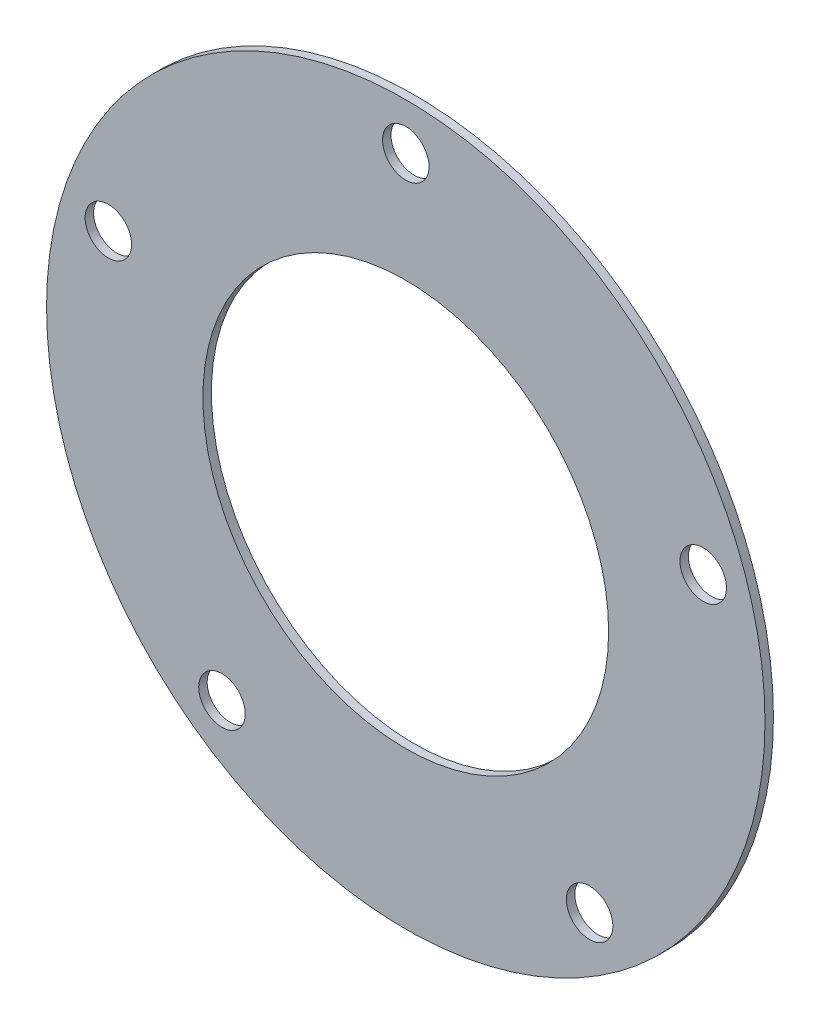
ISO-10303-21;
HEADER;
FILE_DESCRIPTION(('STEP AP214'),'2;1');
FILE_NAME('part.step','',(''),(''),'','','');
FILE_SCHEMA(('AUTOMOTIVE_DESIGN { 1 0 10303 214 1 1 1 1 }'));
ENDSEC;
DATA;
#1=APPLICATION_CONTEXT('core data for automotive mechanical design processes');
#2=APPLICATION_PROTOCOL_DEFINITION('international standard','automotive_design',2000,#1);
#3=PRODUCT_CONTEXT('',#1,'mechanical');
#4=PRODUCT('Part','Part','',(#3));
#5=PRODUCT_RELATED_PRODUCT_CATEGORY('part','',(#4));
#6=PRODUCT_DEFINITION_FORMATION('','',#4);
#7=PRODUCT_DEFINITION_CONTEXT('part definition',#1,'design');
#8=PRODUCT_DEFINITION('design','',#6,#7);
#9=PRODUCT_DEFINITION_SHAPE('','',#8);
#10=(LENGTH_UNIT() NAMED_UNIT(*) SI_UNIT(.MILLI.,.METRE.));
#11=(NAMED_UNIT(*) PLANE_ANGLE_UNIT() SI_UNIT($,.RADIAN.));
#12=(NAMED_UNIT(*) SI_UNIT($,.STERADIAN.) SOLID_ANGLE_UNIT());
#13=UNCERTAINTY_MEASURE_WITH_UNIT(LENGTH_MEASURE(1.E-05),#10,'distance_accuracy_value','');
#14=(GEOMETRIC_REPRESENTATION_CONTEXT(3) GLOBAL_UNCERTAINTY_ASSIGNED_CONTEXT((#13)) GLOBAL_UNIT_ASSIGNED_CONTEXT((#10,
#11,#12)) REPRESENTATION_CONTEXT('',''));
#15=CARTESIAN_POINT('',(0.,0.,0.));
#16=DIRECTION('',(0.,0.,1.));
#17=DIRECTION('',(1.,0.,0.));
#18=AXIS2_PLACEMENT_3D('',#15,#16,#17);
#19=CARTESIAN_POINT('',(0.,0.,1.));
#20=DIRECTION('',(0.,0.,1.));
#21=DIRECTION('',(1.,0.,0.));
#22=AXIS2_PLACEMENT_3D('',#19,#20,#21);
#23=PLANE('',#22);
#24=CARTESIAN_POINT('',(-35.1890911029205,11.4336287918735,1.));
#25=DIRECTION('',(0.,0.,1.));
#26=DIRECTION('',(0.309016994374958,0.95105651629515,0.));
#27=AXIS2_PLACEMENT_3D('',#24,#25,#26);
#28=CIRCLE('',#27,2.75);
#29=CARTESIAN_POINT('',(-34.3392943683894,14.0490342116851,1.));
#30=VERTEX_POINT('',#29);
#31=EDGE_CURVE('E69',#30,#30,#28,.T.);
#32=ORIENTED_EDGE('',*,*,#31,.F.);
#33=EDGE_LOOP('',(#32));
#34=FACE_BOUND('',#33,.T.);
#35=CARTESIAN_POINT('',(-21.7480543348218,-29.9336287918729,1.));
#36=DIRECTION('',(0.,0.,1.));
#37=DIRECTION('',(-0.809016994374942,0.58778525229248,0.));
#38=AXIS2_PLACEMENT_3D('',#35,#36,#37);
#39=CIRCLE('',#38,2.75);
#40=CARTESIAN_POINT('',(-23.9728510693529,-28.3172193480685,1.));
#41=VERTEX_POINT('',#40);
#42=EDGE_CURVE('E63',#41,#41,#39,.T.);
#43=ORIENTED_EDGE('',*,*,#42,.F.);
#44=EDGE_LOOP('',(#43));
#45=FACE_BOUND('',#44,.T.);
#46=CARTESIAN_POINT('',(21.7480543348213,-29.9336287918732,1.));
#47=DIRECTION('',(0.,0.,1.));
#48=DIRECTION('',(-0.809016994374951,-0.587785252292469,0.));
#49=AXIS2_PLACEMENT_3D('',#46,#47,#48);
#50=CIRCLE('',#49,2.75);
#51=CARTESIAN_POINT('',(19.5232576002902,-31.5500382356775,1.));
#52=VERTEX_POINT('',#51);
#53=EDGE_CURVE('E57',#52,#52,#50,.T.);
#54=ORIENTED_EDGE('',*,*,#53,.F.);
#55=EDGE_LOOP('',(#54));
#56=FACE_BOUND('',#55,.T.);
#57=CARTESIAN_POINT('',(35.1890911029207,11.433628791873,1.));
#58=DIRECTION('',(0.,0.,1.));
#59=DIRECTION('',(0.309016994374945,-0.951056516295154,0.));
#60=AXIS2_PLACEMENT_3D('',#57,#58,#59);
#61=CIRCLE('',#60,2.75);
#62=CARTESIAN_POINT('',(36.0388878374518,8.81822337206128,1.));
#63=VERTEX_POINT('',#62);
#64=EDGE_CURVE('E51',#63,#63,#61,.T.);
#65=ORIENTED_EDGE('',*,*,#64,.F.);
#66=EDGE_LOOP('',(#65));
#67=FACE_BOUND('',#66,.T.);
#68=CARTESIAN_POINT('',(0.,37.,1.));
#69=DIRECTION('',(0.,0.,1.));
#70=DIRECTION('',(1.,0.,0.));
#71=AXIS2_PLACEMENT_3D('',#68,#69,#70);
#72=CIRCLE('',#71,2.75);
#73=CARTESIAN_POINT('',(2.75,37.,1.));
#74=VERTEX_POINT('',#73);
#75=EDGE_CURVE('E45',#74,#74,#72,.T.);
#76=ORIENTED_EDGE('',*,*,#75,.F.);
#77=EDGE_LOOP('',(#76));
#78=FACE_BOUND('',#77,.T.);
#79=CARTESIAN_POINT('',(0.,0.,1.));
#80=DIRECTION('',(0.,0.,1.));
#81=DIRECTION('',(1.,0.,0.));
#82=AXIS2_PLACEMENT_3D('',#79,#80,#81);
#83=CIRCLE('',#82,42.5);
#84=CARTESIAN_POINT('',(42.5,0.,1.));
#85=VERTEX_POINT('',#84);
#86=EDGE_CURVE('E10',#85,#85,#83,.T.);
#87=ORIENTED_EDGE('',*,*,#86,.T.);
#88=EDGE_LOOP('',(#87));
#89=FACE_BOUND('',#88,.T.);
#90=CARTESIAN_POINT('',(0.,0.,1.));
#91=DIRECTION('',(0.,0.,1.));
#92=DIRECTION('',(1.,0.,0.));
#93=AXIS2_PLACEMENT_3D('',#90,#91,#92);
#94=CIRCLE('',#93,24.);
#95=CARTESIAN_POINT('',(24.,0.,1.));
#96=VERTEX_POINT('',#95);
#97=EDGE_CURVE('E33',#96,#96,#94,.T.);
#98=ORIENTED_EDGE('',*,*,#97,.F.);
#99=EDGE_LOOP('',(#98));
#100=FACE_BOUND('',#99,.T.);
#101=ADVANCED_FACE('F22',(#34,#45,#56,#67,#78,#89,#100),#23,.T.);
#102=CARTESIAN_POINT('',(0.,0.,0.));
#103=DIRECTION('',(0.,0.,1.));
#104=DIRECTION('',(1.,0.,0.));
#105=AXIS2_PLACEMENT_3D('',#102,#103,#104);
#106=PLANE('',#105);
#107=CARTESIAN_POINT('',(-35.1890911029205,11.4336287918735,0.));
#108=DIRECTION('',(0.,0.,1.));
#109=DIRECTION('',(0.309016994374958,0.95105651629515,0.));
#110=AXIS2_PLACEMENT_3D('',#107,#108,#109);
#111=CIRCLE('',#110,2.75);
#112=CARTESIAN_POINT('',(-34.3392943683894,14.0490342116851,0.));
#113=VERTEX_POINT('',#112);
#114=EDGE_CURVE('E66',#113,#113,#111,.T.);
#115=ORIENTED_EDGE('',*,*,#114,.T.);
#116=EDGE_LOOP('',(#115));
#117=FACE_BOUND('',#116,.T.);
#118=CARTESIAN_POINT('',(-21.7480543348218,-29.9336287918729,0.));
#119=DIRECTION('',(0.,0.,1.));
#120=DIRECTION('',(-0.809016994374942,0.58778525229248,0.));
#121=AXIS2_PLACEMENT_3D('',#118,#119,#120);
#122=CIRCLE('',#121,2.75);
#123=CARTESIAN_POINT('',(-23.9728510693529,-28.3172193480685,0.));
#124=VERTEX_POINT('',#123);
#125=EDGE_CURVE('E60',#124,#124,#122,.T.);
#126=ORIENTED_EDGE('',*,*,#125,.T.);
#127=EDGE_LOOP('',(#126));
#128=FACE_BOUND('',#127,.T.);
#129=CARTESIAN_POINT('',(21.7480543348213,-29.9336287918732,0.));
#130=DIRECTION('',(0.,0.,1.));
#131=DIRECTION('',(-0.809016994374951,-0.587785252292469,0.));
#132=AXIS2_PLACEMENT_3D('',#129,#130,#131);
#133=CIRCLE('',#132,2.75);
#134=CARTESIAN_POINT('',(19.5232576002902,-31.5500382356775,0.));
#135=VERTEX_POINT('',#134);
#136=EDGE_CURVE('E54',#135,#135,#133,.T.);
#137=ORIENTED_EDGE('',*,*,#136,.T.);
#138=EDGE_LOOP('',(#137));
#139=FACE_BOUND('',#138,.T.);
#140=CARTESIAN_POINT('',(35.1890911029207,11.433628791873,0.));
#141=DIRECTION('',(0.,0.,1.));
#142=DIRECTION('',(0.309016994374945,-0.951056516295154,0.));
#143=AXIS2_PLACEMENT_3D('',#140,#141,#142);
#144=CIRCLE('',#143,2.75);
#145=CARTESIAN_POINT('',(36.0388878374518,8.81822337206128,0.));
#146=VERTEX_POINT('',#145);
#147=EDGE_CURVE('E48',#146,#146,#144,.T.);
#148=ORIENTED_EDGE('',*,*,#147,.T.);
#149=EDGE_LOOP('',(#148));
#150=FACE_BOUND('',#149,.T.);
#151=CARTESIAN_POINT('',(0.,37.,0.));
#152=DIRECTION('',(0.,0.,1.));
#153=DIRECTION('',(1.,0.,0.));
#154=AXIS2_PLACEMENT_3D('',#151,#152,#153);
#155=CIRCLE('',#154,2.75);
#156=CARTESIAN_POINT('',(2.75,37.,0.));
#157=VERTEX_POINT('',#156);
#158=EDGE_CURVE('E42',#157,#157,#155,.T.);
#159=ORIENTED_EDGE('',*,*,#158,.T.);
#160=EDGE_LOOP('',(#159));
#161=FACE_BOUND('',#160,.T.);
#162=CARTESIAN_POINT('',(0.,0.,0.));
#163=DIRECTION('',(0.,0.,1.));
#164=DIRECTION('',(1.,0.,0.));
#165=AXIS2_PLACEMENT_3D('',#162,#163,#164);
#166=CIRCLE('',#165,42.5);
#167=CARTESIAN_POINT('',(42.5,0.,0.));
#168=VERTEX_POINT('',#167);
#169=EDGE_CURVE('E29',#168,#168,#166,.T.);
#170=ORIENTED_EDGE('',*,*,#169,.F.);
#171=EDGE_LOOP('',(#170));
#172=FACE_BOUND('',#171,.T.);
#173=CARTESIAN_POINT('',(0.,0.,0.));
#174=DIRECTION('',(0.,0.,1.));
#175=DIRECTION('',(1.,0.,0.));
#176=AXIS2_PLACEMENT_3D('',#173,#174,#175);
#177=CIRCLE('',#176,24.);
#178=CARTESIAN_POINT('',(24.,0.,0.));
#179=VERTEX_POINT('',#178);
#180=EDGE_CURVE('E37',#179,#179,#177,.T.);
#181=ORIENTED_EDGE('',*,*,#180,.T.);
#182=EDGE_LOOP('',(#181));
#183=FACE_BOUND('',#182,.T.);
#184=ADVANCED_FACE('F77',(#117,#128,#139,#150,#161,#172,#183),#106,.F.);
#185=CARTESIAN_POINT('',(0.,0.,1.));
#186=DIRECTION('',(0.,0.,-1.));
#187=DIRECTION('',(-1.,0.,0.));
#188=AXIS2_PLACEMENT_3D('',#185,#186,#187);
#189=CYLINDRICAL_SURFACE('',#188,42.5);
#190=ORIENTED_EDGE('',*,*,#86,.F.);
#191=EDGE_LOOP('',(#190));
#192=FACE_BOUND('',#191,.T.);
#193=ORIENTED_EDGE('',*,*,#169,.T.);
#194=EDGE_LOOP('',(#193));
#195=FACE_BOUND('',#194,.T.);
#196=ADVANCED_FACE('F24',(#192,#195),#189,.T.);
#197=CARTESIAN_POINT('',(0.,0.,1.));
#198=DIRECTION('',(0.,0.,-1.));
#199=DIRECTION('',(-1.,0.,0.));
#200=AXIS2_PLACEMENT_3D('',#197,#198,#199);
#201=CYLINDRICAL_SURFACE('',#200,24.);
#202=ORIENTED_EDGE('',*,*,#97,.T.);
#203=EDGE_LOOP('',(#202));
#204=FACE_BOUND('',#203,.T.);
#205=ORIENTED_EDGE('',*,*,#180,.F.);
#206=EDGE_LOOP('',(#205));
#207=FACE_BOUND('',#206,.T.);
#208=ADVANCED_FACE('F88',(#204,#207),#201,.F.);
#209=CARTESIAN_POINT('',(0.,37.,0.));
#210=DIRECTION('',(0.,0.,1.));
#211=DIRECTION('',(1.,0.,0.));
#212=AXIS2_PLACEMENT_3D('',#209,#210,#211);
#213=CYLINDRICAL_SURFACE('',#212,2.75);
#214=ORIENTED_EDGE('',*,*,#158,.F.);
#215=EDGE_LOOP('',(#214));
#216=FACE_BOUND('',#215,.T.);
#217=ORIENTED_EDGE('',*,*,#75,.T.);
#218=EDGE_LOOP('',(#217));
#219=FACE_BOUND('',#218,.T.);
#220=ADVANCED_FACE('F91',(#216,#219),#213,.F.);
#221=CARTESIAN_POINT('',(35.1890911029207,11.433628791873,0.));
#222=DIRECTION('',(0.,0.,1.));
#223=DIRECTION('',(1.,0.,0.));
#224=AXIS2_PLACEMENT_3D('',#221,#222,#223);
#225=CYLINDRICAL_SURFACE('',#224,2.75);
#226=ORIENTED_EDGE('',*,*,#147,.F.);
#227=EDGE_LOOP('',(#226));
#228=FACE_BOUND('',#227,.T.);
#229=ORIENTED_EDGE('',*,*,#64,.T.);
#230=EDGE_LOOP('',(#229));
#231=FACE_BOUND('',#230,.T.);
#232=ADVANCED_FACE('F106',(#228,#231),#225,.F.);
#233=CARTESIAN_POINT('',(21.7480543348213,-29.9336287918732,0.));
#234=DIRECTION('',(0.,0.,1.));
#235=DIRECTION('',(1.,0.,0.));
#236=AXIS2_PLACEMENT_3D('',#233,#234,#235);
#237=CYLINDRICAL_SURFACE('',#236,2.75);
#238=ORIENTED_EDGE('',*,*,#136,.F.);
#239=EDGE_LOOP('',(#238));
#240=FACE_BOUND('',#239,.T.);
#241=ORIENTED_EDGE('',*,*,#53,.T.);
#242=EDGE_LOOP('',(#241));
#243=FACE_BOUND('',#242,.T.);
#244=ADVANCED_FACE('F110',(#240,#243),#237,.F.);
#245=CARTESIAN_POINT('',(-21.7480543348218,-29.9336287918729,0.));
#246=DIRECTION('',(0.,0.,1.));
#247=DIRECTION('',(1.,0.,0.));
#248=AXIS2_PLACEMENT_3D('',#245,#246,#247);
#249=CYLINDRICAL_SURFACE('',#248,2.75);
#250=ORIENTED_EDGE('',*,*,#125,.F.);
#251=EDGE_LOOP('',(#250));
#252=FACE_BOUND('',#251,.T.);
#253=ORIENTED_EDGE('',*,*,#42,.T.);
#254=EDGE_LOOP('',(#253));
#255=FACE_BOUND('',#254,.T.);
#256=ADVANCED_FACE('F114',(#252,#255),#249,.F.);
#257=CARTESIAN_POINT('',(-35.1890911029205,11.4336287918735,0.));
#258=DIRECTION('',(0.,0.,1.));
#259=DIRECTION('',(1.,0.,0.));
#260=AXIS2_PLACEMENT_3D('',#257,#258,#259);
#261=CYLINDRICAL_SURFACE('',#260,2.75);
#262=ORIENTED_EDGE('',*,*,#114,.F.);
#263=EDGE_LOOP('',(#262));
#264=FACE_BOUND('',#263,.T.);
#265=ORIENTED_EDGE('',*,*,#31,.T.);
#266=EDGE_LOOP('',(#265));
#267=FACE_BOUND('',#266,.T.);
#268=ADVANCED_FACE('F73',(#264,#267),#261,.F.);
#269=CLOSED_SHELL('',(#101,#184,#196,#208,#220,#232,#244,#256,#268));
#270=MANIFOLD_SOLID_BREP('B2',#269);
#271=ADVANCED_BREP_SHAPE_REPRESENTATION('',(#18,#270),#14);
#272=SHAPE_DEFINITION_REPRESENTATION(#9,#271);
ENDSEC;
END-ISO-10303-21;
